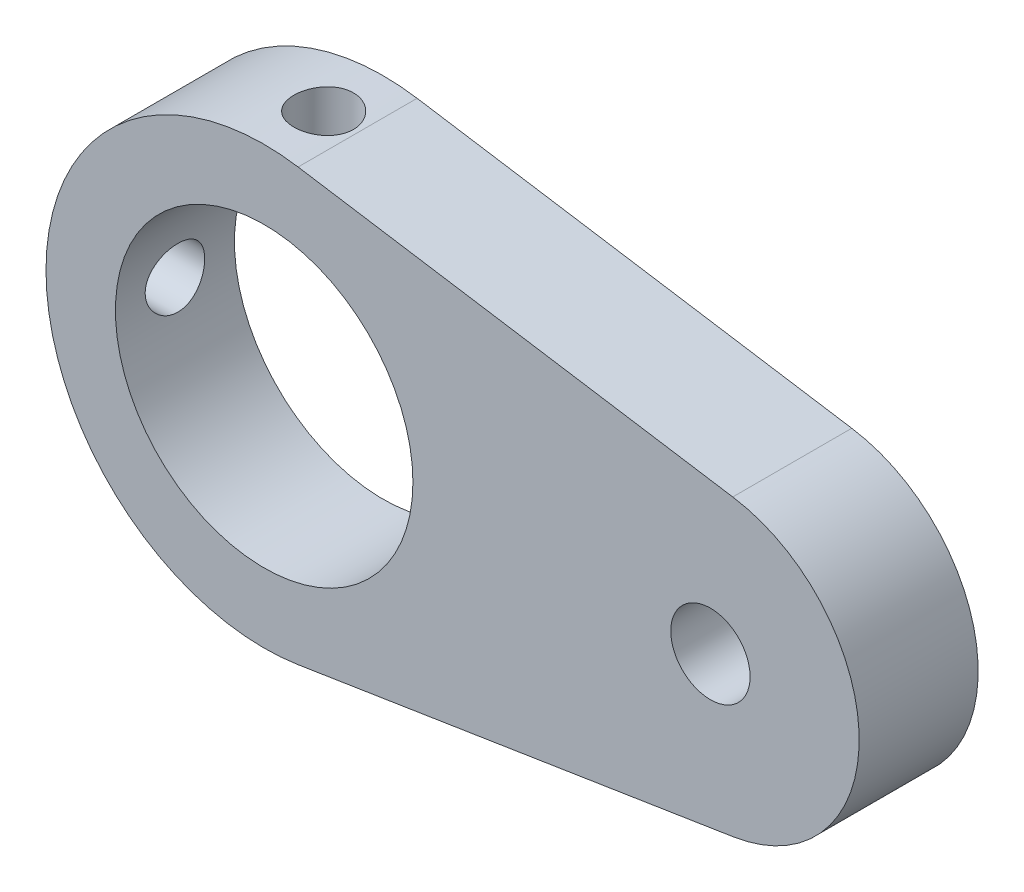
ISO-10303-21;
HEADER;
FILE_DESCRIPTION(('STEP AP214'),'2;1');
FILE_NAME('part.step','',(''),(''),'','','');
FILE_SCHEMA(('AUTOMOTIVE_DESIGN { 1 0 10303 214 1 1 1 1 }'));
ENDSEC;
DATA;
#1=APPLICATION_CONTEXT('core data for automotive mechanical design processes');
#2=APPLICATION_PROTOCOL_DEFINITION('international standard','automotive_design',2000,#1);
#3=PRODUCT_CONTEXT('',#1,'mechanical');
#4=PRODUCT('Part','Part','',(#3));
#5=PRODUCT_RELATED_PRODUCT_CATEGORY('part','',(#4));
#6=PRODUCT_DEFINITION_FORMATION('','',#4);
#7=PRODUCT_DEFINITION_CONTEXT('part definition',#1,'design');
#8=PRODUCT_DEFINITION('design','',#6,#7);
#9=PRODUCT_DEFINITION_SHAPE('','',#8);
#10=(LENGTH_UNIT() NAMED_UNIT(*) SI_UNIT(.MILLI.,.METRE.));
#11=(NAMED_UNIT(*) PLANE_ANGLE_UNIT() SI_UNIT($,.RADIAN.));
#12=(NAMED_UNIT(*) SI_UNIT($,.STERADIAN.) SOLID_ANGLE_UNIT());
#13=UNCERTAINTY_MEASURE_WITH_UNIT(LENGTH_MEASURE(1.E-05),#10,'distance_accuracy_value','');
#14=(GEOMETRIC_REPRESENTATION_CONTEXT(3) GLOBAL_UNCERTAINTY_ASSIGNED_CONTEXT((#13)) GLOBAL_UNIT_ASSIGNED_CONTEXT((#10,
#11,#12)) REPRESENTATION_CONTEXT('',''));
#15=CARTESIAN_POINT('',(0.,0.,0.));
#16=DIRECTION('',(0.,0.,1.));
#17=DIRECTION('',(1.,0.,0.));
#18=AXIS2_PLACEMENT_3D('',#15,#16,#17);
#19=CARTESIAN_POINT('',(0.,0.,12.));
#20=DIRECTION('',(0.,0.,-1.));
#21=DIRECTION('',(-1.,0.,0.));
#22=AXIS2_PLACEMENT_3D('',#19,#20,#21);
#23=CYLINDRICAL_SURFACE('',#22,22.);
#24=CARTESIAN_POINT('',(0.,22.,9.));
#25=CARTESIAN_POINT('',(-0.167676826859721,21.9999974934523,8.99999296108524));
#26=CARTESIAN_POINT('',(-0.335455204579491,21.9980628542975,8.98589481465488));
#27=CARTESIAN_POINT('',(-0.666334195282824,21.990531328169,8.92988223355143));
#28=CARTESIAN_POINT('',(-0.829429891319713,21.984930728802,8.88793960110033));
#29=CARTESIAN_POINT('',(-1.14610618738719,21.9706975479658,8.77750453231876));
#30=CARTESIAN_POINT('',(-1.29969344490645,21.9620671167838,8.70903092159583));
#31=CARTESIAN_POINT('',(-1.59317060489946,21.9427314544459,8.54752095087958));
#32=CARTESIAN_POINT('',(-1.73306265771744,21.9320265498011,8.45448845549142));
#33=CARTESIAN_POINT('',(-1.99611512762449,21.9096571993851,8.24585557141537));
#34=CARTESIAN_POINT('',(-2.11917356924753,21.8979875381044,8.13012715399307));
#35=CARTESIAN_POINT('',(-2.34418667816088,21.8750454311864,7.87966277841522));
#36=CARTESIAN_POINT('',(-2.44614021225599,21.863773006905,7.74492580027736));
#37=CARTESIAN_POINT('',(-2.62643701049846,21.8428507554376,7.45959612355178));
#38=CARTESIAN_POINT('',(-2.70468332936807,21.833207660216,7.30894162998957));
#39=CARTESIAN_POINT('',(-2.83472528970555,21.8167058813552,6.99647636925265));
#40=CARTESIAN_POINT('',(-2.8865221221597,21.8098470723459,6.83466610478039));
#41=CARTESIAN_POINT('',(-2.9618818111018,21.7997409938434,6.50554751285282));
#42=CARTESIAN_POINT('',(-2.98561797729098,21.7964715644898,6.33827956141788));
#43=CARTESIAN_POINT('',(-3.00471910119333,21.7938468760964,6.00210505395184));
#44=CARTESIAN_POINT('',(-3.00008540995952,21.7944914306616,5.83319857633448));
#45=CARTESIAN_POINT('',(-2.9627203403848,21.7996016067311,5.49975654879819));
#46=CARTESIAN_POINT('',(-2.9301807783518,21.8040411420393,5.33519904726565));
#47=CARTESIAN_POINT('',(-2.83822735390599,21.8162003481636,5.0139019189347));
#48=CARTESIAN_POINT('',(-2.77881285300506,21.8239200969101,4.85716247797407));
#49=CARTESIAN_POINT('',(-2.63459283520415,21.841799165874,4.55536014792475));
#50=CARTESIAN_POINT('',(-2.54970487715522,21.851966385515,4.41033714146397));
#51=CARTESIAN_POINT('',(-2.35700646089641,21.8735888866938,4.13652170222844));
#52=CARTESIAN_POINT('',(-2.24919475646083,21.8850442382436,4.00773015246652));
#53=CARTESIAN_POINT('',(-2.01265055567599,21.908067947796,3.76892089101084));
#54=CARTESIAN_POINT('',(-1.88375290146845,21.9196364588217,3.65906671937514));
#55=CARTESIAN_POINT('',(-1.60926188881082,21.9414949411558,3.46252701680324));
#56=CARTESIAN_POINT('',(-1.46366847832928,21.9517849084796,3.37584155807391));
#57=CARTESIAN_POINT('',(-1.1597859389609,21.9699350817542,3.22809627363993));
#58=CARTESIAN_POINT('',(-1.00149126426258,21.9777942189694,3.16704771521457));
#59=CARTESIAN_POINT('',(-0.676766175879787,21.9901879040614,3.07244432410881));
#60=CARTESIAN_POINT('',(-0.510336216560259,21.994722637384,3.03888795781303));
#61=CARTESIAN_POINT('',(-0.175477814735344,21.9999322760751,3.00043583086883));
#62=CARTESIAN_POINT('',(-0.0070756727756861,22.0006374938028,2.99531498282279));
#63=CARTESIAN_POINT('',(0.328184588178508,21.9981907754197,3.01328375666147));
#64=CARTESIAN_POINT('',(0.495042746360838,21.9950389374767,3.03637266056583));
#65=CARTESIAN_POINT('',(0.821806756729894,21.9852510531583,3.10991844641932));
#66=CARTESIAN_POINT('',(0.981737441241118,21.9786288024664,3.16026699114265));
#67=CARTESIAN_POINT('',(1.29088628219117,21.9626408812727,3.28678951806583));
#68=CARTESIAN_POINT('',(1.44010401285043,21.9532751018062,3.36296452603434));
#69=CARTESIAN_POINT('',(1.72458978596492,21.9327672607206,3.53951507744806));
#70=CARTESIAN_POINT('',(1.85976745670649,21.921614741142,3.64003500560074));
#71=CARTESIAN_POINT('',(2.11141402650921,21.8988110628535,3.86221915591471));
#72=CARTESIAN_POINT('',(2.22788203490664,21.8871598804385,3.98388438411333));
#73=CARTESIAN_POINT('',(2.43961065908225,21.8645773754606,4.24590166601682));
#74=CARTESIAN_POINT('',(2.53472132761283,21.8536515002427,4.38637542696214));
#75=CARTESIAN_POINT('',(2.69999679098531,21.8338493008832,4.68143661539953));
#76=CARTESIAN_POINT('',(2.77016216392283,21.8249729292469,4.83602371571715));
#77=CARTESIAN_POINT('',(2.88331699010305,21.8103129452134,5.15445551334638));
#78=CARTESIAN_POINT('',(2.92638854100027,21.8045199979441,5.31827058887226));
#79=CARTESIAN_POINT('',(2.98439621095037,21.7966568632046,5.65089304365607));
#80=CARTESIAN_POINT('',(2.99933390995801,21.7945864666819,5.8197001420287));
#81=CARTESIAN_POINT('',(3.00061713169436,21.7944097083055,6.15602195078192));
#82=CARTESIAN_POINT('',(2.98719829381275,21.796270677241,6.3235357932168));
#83=CARTESIAN_POINT('',(2.93265092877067,21.8036764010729,6.65390227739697));
#84=CARTESIAN_POINT('',(2.89152241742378,21.809221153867,6.81675492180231));
#85=CARTESIAN_POINT('',(2.7828011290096,21.8233590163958,7.13313027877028));
#86=CARTESIAN_POINT('',(2.71522193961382,21.8319505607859,7.28665773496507));
#87=CARTESIAN_POINT('',(2.5555407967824,21.85121622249,7.58023259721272));
#88=CARTESIAN_POINT('',(2.46343830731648,21.8618903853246,7.7202797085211));
#89=CARTESIAN_POINT('',(2.25645830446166,21.884224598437,7.98412007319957));
#90=CARTESIAN_POINT('',(2.14140556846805,21.8958918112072,8.10777527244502));
#91=CARTESIAN_POINT('',(1.89215973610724,21.9188357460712,8.33411069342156));
#92=CARTESIAN_POINT('',(1.7579621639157,21.9301123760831,8.43678599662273));
#93=CARTESIAN_POINT('',(1.473530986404,21.9510618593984,8.61865193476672));
#94=CARTESIAN_POINT('',(1.32322763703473,21.9607272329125,8.69773431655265));
#95=CARTESIAN_POINT('',(1.01141938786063,21.9772907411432,8.82941896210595));
#96=CARTESIAN_POINT('',(0.849926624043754,21.9841918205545,8.8820494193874));
#97=CARTESIAN_POINT('',(0.57303719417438,21.9928235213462,8.94702087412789));
#98=CARTESIAN_POINT('',(0.459371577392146,21.9955012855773,8.96685872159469));
#99=CARTESIAN_POINT('',(0.230486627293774,21.9990903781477,8.99335064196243));
#100=CARTESIAN_POINT('',(0.115267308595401,22.0000017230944,9.0000048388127));
#101=CARTESIAN_POINT('',(0.,22.,9.));
#102=B_SPLINE_CURVE_WITH_KNOTS('',3,(#24,#25,#26,#27,#28,#29,#30,#31,#32,#33,#34,#35,#36,#37,
#38,#39,#40,#41,#42,#43,#44,#45,#46,#47,#48,#49,#50,#51,#52,#53,#54,#55,#56,#57,#58,#59,#60,#61,
#62,#63,#64,#65,#66,#67,#68,#69,#70,#71,#72,#73,#74,#75,#76,#77,#78,#79,#80,#81,#82,#83,#84,#85,
#86,#87,#88,#89,#90,#91,#92,#93,#94,#95,#96,#97,#98,#99,#100,#101),.UNSPECIFIED.,.T.,.F.,(4,2,2,
2,2,2,2,2,2,2,2,2,2,2,2,2,2,2,2,2,2,2,2,2,2,2,2,2,2,2,2,2,2,2,2,2,2,2,4),(0.,0.5026093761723,
1.00572851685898,1.50849131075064,2.0111750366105,2.51678051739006,3.02241313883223,
3.53008635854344,4.03773671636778,4.54223504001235,5.04670933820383,5.54774357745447,
6.04878972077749,6.55147524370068,7.05418810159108,7.56104569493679,8.06790486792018,
8.57498657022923,9.08203998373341,9.58507392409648,10.0880950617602,10.5891315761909,
11.0901879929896,11.5942921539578,12.0984203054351,12.6059843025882,13.1135365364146,
13.619543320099,14.1255216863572,14.6273119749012,15.1291019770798,15.6306345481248,
16.1321780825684,16.6377084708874,17.1433572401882,17.6512916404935,18.1586835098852,
18.5041992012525,18.8497116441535),.UNSPECIFIED.);
#103=CARTESIAN_POINT('',(0.,22.,9.));
#104=VERTEX_POINT('',#103);
#105=EDGE_CURVE('E121',#104,#104,#102,.T.);
#106=ORIENTED_EDGE('',*,*,#105,.T.);
#107=EDGE_LOOP('',(#106));
#108=FACE_BOUND('',#107,.T.);
#109=CARTESIAN_POINT('',(0.,0.,0.));
#110=DIRECTION('',(0.,0.,1.));
#111=DIRECTION('',(1.,0.,0.));
#112=AXIS2_PLACEMENT_3D('',#109,#110,#111);
#113=CIRCLE('',#112,22.);
#114=CARTESIAN_POINT('',(3.42233737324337,21.7321790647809,0.));
#115=VERTEX_POINT('',#114);
#116=CARTESIAN_POINT('',(3.42233737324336,-21.7321790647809,0.));
#117=VERTEX_POINT('',#116);
#118=EDGE_CURVE('E76',#115,#117,#113,.T.);
#119=ORIENTED_EDGE('',*,*,#118,.T.);
#120=DIRECTION('',(0.,0.,-1.));
#121=VECTOR('',#120,1.);
#122=CARTESIAN_POINT('',(3.42233737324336,-21.7321790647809,12.));
#123=LINE('',#122,#121);
#124=CARTESIAN_POINT('',(3.42233737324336,-21.7321790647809,12.));
#125=VERTEX_POINT('',#124);
#126=EDGE_CURVE('E100',#125,#117,#123,.T.);
#127=ORIENTED_EDGE('',*,*,#126,.F.);
#128=CARTESIAN_POINT('',(0.,0.,12.));
#129=DIRECTION('',(0.,0.,1.));
#130=DIRECTION('',(1.,0.,0.));
#131=AXIS2_PLACEMENT_3D('',#128,#129,#130);
#132=CIRCLE('',#131,22.);
#133=CARTESIAN_POINT('',(3.42233737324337,21.7321790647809,12.));
#134=VERTEX_POINT('',#133);
#135=EDGE_CURVE('E93',#134,#125,#132,.T.);
#136=ORIENTED_EDGE('',*,*,#135,.F.);
#137=DIRECTION('',(0.,0.,-1.));
#138=VECTOR('',#137,1.);
#139=CARTESIAN_POINT('',(3.42233737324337,21.7321790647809,12.));
#140=LINE('',#139,#138);
#141=EDGE_CURVE('E50',#134,#115,#140,.T.);
#142=ORIENTED_EDGE('',*,*,#141,.T.);
#143=EDGE_LOOP('',(#119,#127,#136,#142));
#144=FACE_BOUND('',#143,.T.);
#145=CARTESIAN_POINT('',(-22.,0.,9.));
#146=CARTESIAN_POINT('',(-21.9999974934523,0.167676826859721,8.99999296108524));
#147=CARTESIAN_POINT('',(-21.9980628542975,0.335455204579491,8.98589481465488));
#148=CARTESIAN_POINT('',(-21.990531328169,0.666334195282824,8.92988223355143));
#149=CARTESIAN_POINT('',(-21.984930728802,0.829429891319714,8.88793960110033));
#150=CARTESIAN_POINT('',(-21.9706975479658,1.14610618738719,8.77750453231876));
#151=CARTESIAN_POINT('',(-21.9620671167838,1.29969344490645,8.70903092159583));
#152=CARTESIAN_POINT('',(-21.9427314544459,1.59317060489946,8.54752095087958));
#153=CARTESIAN_POINT('',(-21.9320265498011,1.73306265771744,8.45448845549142));
#154=CARTESIAN_POINT('',(-21.9096571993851,1.99611512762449,8.24585557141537));
#155=CARTESIAN_POINT('',(-21.8979875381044,2.11917356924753,8.13012715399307));
#156=CARTESIAN_POINT('',(-21.8750454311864,2.34418667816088,7.87966277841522));
#157=CARTESIAN_POINT('',(-21.863773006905,2.44614021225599,7.74492580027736));
#158=CARTESIAN_POINT('',(-21.8428507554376,2.62643701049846,7.45959612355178));
#159=CARTESIAN_POINT('',(-21.833207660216,2.70468332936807,7.30894162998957));
#160=CARTESIAN_POINT('',(-21.8167058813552,2.83472528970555,6.99647636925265));
#161=CARTESIAN_POINT('',(-21.8098470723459,2.8865221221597,6.83466610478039));
#162=CARTESIAN_POINT('',(-21.7997409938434,2.9618818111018,6.50554751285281));
#163=CARTESIAN_POINT('',(-21.7964715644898,2.98561797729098,6.33827956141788));
#164=CARTESIAN_POINT('',(-21.7938468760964,3.00471910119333,6.00210505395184));
#165=CARTESIAN_POINT('',(-21.7944914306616,3.00008540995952,5.83319857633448));
#166=CARTESIAN_POINT('',(-21.7996016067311,2.9627203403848,5.49975654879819));
#167=CARTESIAN_POINT('',(-21.8040411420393,2.9301807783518,5.33519904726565));
#168=CARTESIAN_POINT('',(-21.8162003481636,2.83822735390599,5.0139019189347));
#169=CARTESIAN_POINT('',(-21.8239200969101,2.77881285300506,4.85716247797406));
#170=CARTESIAN_POINT('',(-21.841799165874,2.63459283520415,4.55536014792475));
#171=CARTESIAN_POINT('',(-21.851966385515,2.54970487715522,4.41033714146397));
#172=CARTESIAN_POINT('',(-21.8735888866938,2.3570064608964,4.13652170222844));
#173=CARTESIAN_POINT('',(-21.8850442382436,2.24919475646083,4.00773015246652));
#174=CARTESIAN_POINT('',(-21.908067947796,2.01265055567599,3.76892089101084));
#175=CARTESIAN_POINT('',(-21.9196364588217,1.88375290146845,3.65906671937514));
#176=CARTESIAN_POINT('',(-21.9414949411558,1.60926188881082,3.46252701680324));
#177=CARTESIAN_POINT('',(-21.9517849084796,1.46366847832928,3.37584155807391));
#178=CARTESIAN_POINT('',(-21.9699350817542,1.15978593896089,3.22809627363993));
#179=CARTESIAN_POINT('',(-21.9777942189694,1.00149126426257,3.16704771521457));
#180=CARTESIAN_POINT('',(-21.9901879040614,0.676766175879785,3.07244432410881));
#181=CARTESIAN_POINT('',(-21.994722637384,0.510336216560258,3.03888795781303));
#182=CARTESIAN_POINT('',(-21.9999322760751,0.175477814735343,3.00043583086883));
#183=CARTESIAN_POINT('',(-22.0006374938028,0.00707567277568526,2.99531498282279));
#184=CARTESIAN_POINT('',(-21.9981907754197,-0.328184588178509,3.01328375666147));
#185=CARTESIAN_POINT('',(-21.9950389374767,-0.495042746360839,3.03637266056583));
#186=CARTESIAN_POINT('',(-21.9852510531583,-0.821806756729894,3.10991844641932));
#187=CARTESIAN_POINT('',(-21.9786288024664,-0.981737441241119,3.16026699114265));
#188=CARTESIAN_POINT('',(-21.9626408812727,-1.29088628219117,3.28678951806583));
#189=CARTESIAN_POINT('',(-21.9532751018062,-1.44010401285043,3.36296452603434));
#190=CARTESIAN_POINT('',(-21.9327672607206,-1.72458978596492,3.53951507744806));
#191=CARTESIAN_POINT('',(-21.921614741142,-1.85976745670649,3.64003500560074));
#192=CARTESIAN_POINT('',(-21.8988110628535,-2.11141402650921,3.86221915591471));
#193=CARTESIAN_POINT('',(-21.8871598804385,-2.22788203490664,3.98388438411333));
#194=CARTESIAN_POINT('',(-21.8645773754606,-2.43961065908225,4.24590166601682));
#195=CARTESIAN_POINT('',(-21.8536515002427,-2.53472132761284,4.38637542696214));
#196=CARTESIAN_POINT('',(-21.8338493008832,-2.69999679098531,4.68143661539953));
#197=CARTESIAN_POINT('',(-21.8249729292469,-2.77016216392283,4.83602371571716));
#198=CARTESIAN_POINT('',(-21.8103129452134,-2.88331699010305,5.15445551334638));
#199=CARTESIAN_POINT('',(-21.8045199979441,-2.92638854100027,5.31827058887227));
#200=CARTESIAN_POINT('',(-21.7966568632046,-2.98439621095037,5.65089304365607));
#201=CARTESIAN_POINT('',(-21.7945864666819,-2.99933390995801,5.8197001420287));
#202=CARTESIAN_POINT('',(-21.7944097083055,-3.00061713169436,6.15602195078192));
#203=CARTESIAN_POINT('',(-21.796270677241,-2.98719829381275,6.3235357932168));
#204=CARTESIAN_POINT('',(-21.8036764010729,-2.93265092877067,6.65390227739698));
#205=CARTESIAN_POINT('',(-21.809221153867,-2.89152241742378,6.81675492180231));
#206=CARTESIAN_POINT('',(-21.8233590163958,-2.7828011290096,7.13313027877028));
#207=CARTESIAN_POINT('',(-21.8319505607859,-2.71522193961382,7.28665773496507));
#208=CARTESIAN_POINT('',(-21.85121622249,-2.55554079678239,7.58023259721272));
#209=CARTESIAN_POINT('',(-21.8618903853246,-2.46343830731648,7.72027970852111));
#210=CARTESIAN_POINT('',(-21.884224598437,-2.25645830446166,7.98412007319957));
#211=CARTESIAN_POINT('',(-21.8958918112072,-2.14140556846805,8.10777527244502));
#212=CARTESIAN_POINT('',(-21.9188357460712,-1.89215973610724,8.33411069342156));
#213=CARTESIAN_POINT('',(-21.9301123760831,-1.7579621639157,8.43678599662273));
#214=CARTESIAN_POINT('',(-21.9510618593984,-1.473530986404,8.61865193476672));
#215=CARTESIAN_POINT('',(-21.9607272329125,-1.32322763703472,8.69773431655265));
#216=CARTESIAN_POINT('',(-21.9772907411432,-1.01141938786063,8.82941896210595));
#217=CARTESIAN_POINT('',(-21.9841918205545,-0.849926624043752,8.88204941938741));
#218=CARTESIAN_POINT('',(-21.9928235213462,-0.573037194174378,8.94702087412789));
#219=CARTESIAN_POINT('',(-21.9955012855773,-0.459371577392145,8.96685872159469));
#220=CARTESIAN_POINT('',(-21.9990903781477,-0.230486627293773,8.99335064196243));
#221=CARTESIAN_POINT('',(-22.0000017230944,-0.1152673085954,9.0000048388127));
#222=CARTESIAN_POINT('',(-22.,0.,9.));
#223=B_SPLINE_CURVE_WITH_KNOTS('',3,(#145,#146,#147,#148,#149,#150,#151,#152,#153,#154,#155,
#156,#157,#158,#159,#160,#161,#162,#163,#164,#165,#166,#167,#168,#169,#170,#171,#172,#173,#174,
#175,#176,#177,#178,#179,#180,#181,#182,#183,#184,#185,#186,#187,#188,#189,#190,#191,#192,#193,
#194,#195,#196,#197,#198,#199,#200,#201,#202,#203,#204,#205,#206,#207,#208,#209,#210,#211,#212,
#213,#214,#215,#216,#217,#218,#219,#220,#221,#222),.UNSPECIFIED.,.T.,.F.,(4,2,2,2,2,2,2,2,2,2,2,
2,2,2,2,2,2,2,2,2,2,2,2,2,2,2,2,2,2,2,2,2,2,2,2,2,2,2,4),(0.,0.5026093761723,1.00572851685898,
1.50849131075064,2.0111750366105,2.51678051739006,3.02241313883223,3.53008635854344,
4.03773671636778,4.54223504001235,5.04670933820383,5.54774357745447,6.04878972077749,
6.55147524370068,7.05418810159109,7.56104569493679,8.06790486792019,8.57498657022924,
9.08203998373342,9.58507392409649,10.0880950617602,10.5891315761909,11.0901879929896,
11.5942921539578,12.0984203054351,12.6059843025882,13.1135365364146,13.619543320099,
14.1255216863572,14.6273119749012,15.1291019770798,15.6306345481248,16.1321780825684,
16.6377084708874,17.1433572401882,17.6512916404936,18.1586835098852,18.5041992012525,
18.8497116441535),.UNSPECIFIED.);
#224=CARTESIAN_POINT('',(-22.,0.,9.));
#225=VERTEX_POINT('',#224);
#226=EDGE_CURVE('E122',#225,#225,#223,.T.);
#227=ORIENTED_EDGE('',*,*,#226,.F.);
#228=EDGE_LOOP('',(#227));
#229=FACE_BOUND('',#228,.T.);
#230=ADVANCED_FACE('F36',(#108,#144,#229),#23,.T.);
#231=CARTESIAN_POINT('',(0.,0.,12.));
#232=DIRECTION('',(0.,0.,-1.));
#233=DIRECTION('',(-1.,0.,0.));
#234=AXIS2_PLACEMENT_3D('',#231,#232,#233);
#235=CYLINDRICAL_SURFACE('',#234,15.);
#236=CARTESIAN_POINT('',(0.,0.,0.));
#237=DIRECTION('',(0.,0.,1.));
#238=DIRECTION('',(1.,0.,0.));
#239=AXIS2_PLACEMENT_3D('',#236,#237,#238);
#240=CIRCLE('',#239,15.);
#241=CARTESIAN_POINT('',(15.,0.,0.));
#242=VERTEX_POINT('',#241);
#243=EDGE_CURVE('E170',#242,#242,#240,.T.);
#244=ORIENTED_EDGE('',*,*,#243,.F.);
#245=EDGE_LOOP('',(#244));
#246=FACE_BOUND('',#245,.T.);
#247=CARTESIAN_POINT('',(0.,0.,12.));
#248=DIRECTION('',(0.,0.,1.));
#249=DIRECTION('',(1.,0.,0.));
#250=AXIS2_PLACEMENT_3D('',#247,#248,#249);
#251=CIRCLE('',#250,15.);
#252=CARTESIAN_POINT('',(15.,0.,12.));
#253=VERTEX_POINT('',#252);
#254=EDGE_CURVE('E111',#253,#253,#251,.T.);
#255=ORIENTED_EDGE('',*,*,#254,.T.);
#256=EDGE_LOOP('',(#255));
#257=FACE_BOUND('',#256,.T.);
#258=CARTESIAN_POINT('',(0.,15.,9.));
#259=CARTESIAN_POINT('',(-0.166730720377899,14.9999969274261,8.99999386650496));
#260=CARTESIAN_POINT('',(-0.333538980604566,14.9971915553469,8.98605347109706));
#261=CARTESIAN_POINT('',(-0.662440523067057,14.9862709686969,8.93070449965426));
#262=CARTESIAN_POINT('',(-0.824529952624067,14.9781515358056,8.88927410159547));
#263=CARTESIAN_POINT('',(-1.13919091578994,14.9575094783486,8.78027617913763));
#264=CARTESIAN_POINT('',(-1.2917714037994,14.9449910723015,8.71273368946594));
#265=CARTESIAN_POINT('',(-1.58342396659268,14.9169119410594,8.55350325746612));
#266=CARTESIAN_POINT('',(-1.72249684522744,14.9013513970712,8.46181675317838));
#267=CARTESIAN_POINT('',(-1.98508043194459,14.8686649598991,8.2555845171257));
#268=CARTESIAN_POINT('',(-2.10838185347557,14.8515223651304,8.14077493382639));
#269=CARTESIAN_POINT('',(-2.33411026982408,14.8177254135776,7.89212275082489));
#270=CARTESIAN_POINT('',(-2.43653563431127,14.8010710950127,7.75827866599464));
#271=CARTESIAN_POINT('',(-2.61849526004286,14.7699732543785,7.47385142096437));
#272=CARTESIAN_POINT('',(-2.6978128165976,14.7555512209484,7.32312706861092));
#273=CARTESIAN_POINT('',(-2.82991699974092,14.7307880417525,7.01015454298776));
#274=CARTESIAN_POINT('',(-2.88270624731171,14.7204464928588,6.84790750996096));
#275=CARTESIAN_POINT('',(-2.95957589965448,14.7051841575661,6.51874690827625));
#276=CARTESIAN_POINT('',(-2.98402349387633,14.7001941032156,6.35192236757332));
#277=CARTESIAN_POINT('',(-3.00465638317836,14.6959912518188,6.01647053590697));
#278=CARTESIAN_POINT('',(-3.0008445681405,14.6967778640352,5.84784343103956));
#279=CARTESIAN_POINT('',(-2.96536371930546,14.7039765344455,5.51625963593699));
#280=CARTESIAN_POINT('',(-2.93411562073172,14.7103035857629,5.35325578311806));
#281=CARTESIAN_POINT('',(-2.84531365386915,14.7277363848,5.03485177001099));
#282=CARTESIAN_POINT('',(-2.78775852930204,14.7388423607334,4.87945197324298));
#283=CARTESIAN_POINT('',(-2.64757435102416,14.7646685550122,4.5794542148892));
#284=CARTESIAN_POINT('',(-2.56477845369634,14.7794126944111,4.43493636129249));
#285=CARTESIAN_POINT('',(-2.37658072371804,14.8108385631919,4.16168745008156));
#286=CARTESIAN_POINT('',(-2.27117629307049,14.827520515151,4.03295820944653));
#287=CARTESIAN_POINT('',(-2.03849980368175,14.8613106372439,3.79251179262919));
#288=CARTESIAN_POINT('',(-1.91086848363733,14.8784210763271,3.68114229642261));
#289=CARTESIAN_POINT('',(-1.63855507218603,14.9108654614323,3.48133846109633));
#290=CARTESIAN_POINT('',(-1.49387276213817,14.9261993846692,3.39290441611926));
#291=CARTESIAN_POINT('',(-1.19117816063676,14.9534007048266,3.24141747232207));
#292=CARTESIAN_POINT('',(-1.0331454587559,14.9652626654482,3.17840431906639));
#293=CARTESIAN_POINT('',(-0.708446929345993,14.9841422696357,3.0799185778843));
#294=CARTESIAN_POINT('',(-0.541782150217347,14.9911605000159,3.04444265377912));
#295=CARTESIAN_POINT('',(-0.20753821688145,14.999480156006,3.00253063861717));
#296=CARTESIAN_POINT('',(-0.0400209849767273,15.0008752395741,2.99561874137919));
#297=CARTESIAN_POINT('',(0.293774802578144,14.9980515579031,3.00974957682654));
#298=CARTESIAN_POINT('',(0.460053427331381,14.9938331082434,3.03079073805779));
#299=CARTESIAN_POINT('',(0.785116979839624,14.9803149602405,3.09983512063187));
#300=CARTESIAN_POINT('',(0.94395584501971,14.9710612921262,3.14759420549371));
#301=CARTESIAN_POINT('',(1.251370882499,14.948506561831,3.26845194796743));
#302=CARTESIAN_POINT('',(1.39994628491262,14.9352051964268,3.34155250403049));
#303=CARTESIAN_POINT('',(1.68462352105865,14.9057973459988,3.51204747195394));
#304=CARTESIAN_POINT('',(1.82055038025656,14.8896585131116,3.60972834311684));
#305=CARTESIAN_POINT('',(2.07425405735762,14.8564420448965,3.82622757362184));
#306=CARTESIAN_POINT('',(2.19202892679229,14.8393643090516,3.9450481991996));
#307=CARTESIAN_POINT('',(2.40792177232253,14.8058791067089,4.20262005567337));
#308=CARTESIAN_POINT('',(2.50571310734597,14.7894858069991,4.34164723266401));
#309=CARTESIAN_POINT('',(2.67655626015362,14.7595257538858,4.63443408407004));
#310=CARTESIAN_POINT('',(2.74960906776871,14.7459588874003,4.78819316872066));
#311=CARTESIAN_POINT('',(2.86845552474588,14.7233022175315,5.10530473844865));
#312=CARTESIAN_POINT('',(2.91439049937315,14.7141892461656,5.26860252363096));
#313=CARTESIAN_POINT('',(2.97812595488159,14.7014231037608,5.60080036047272));
#314=CARTESIAN_POINT('',(2.99593010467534,14.6977692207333,5.76969967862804));
#315=CARTESIAN_POINT('',(3.00276273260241,14.6963744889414,6.10502659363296));
#316=CARTESIAN_POINT('',(2.99230736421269,14.698527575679,6.27144344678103));
#317=CARTESIAN_POINT('',(2.94405691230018,14.7082672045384,6.60009494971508));
#318=CARTESIAN_POINT('',(2.90626204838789,14.7158537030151,6.76232963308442));
#319=CARTESIAN_POINT('',(2.80463570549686,14.7355579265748,7.07768313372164));
#320=CARTESIAN_POINT('',(2.74086752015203,14.7476646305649,7.23082308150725));
#321=CARTESIAN_POINT('',(2.58916393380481,14.7750514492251,7.52431116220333));
#322=CARTESIAN_POINT('',(2.50122650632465,14.7903318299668,7.66465822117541));
#323=CARTESIAN_POINT('',(2.30191774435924,14.8226688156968,7.93114671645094));
#324=CARTESIAN_POINT('',(2.19017366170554,14.839751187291,8.05700629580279));
#325=CARTESIAN_POINT('',(1.94719310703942,14.8735824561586,8.28835861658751));
#326=CARTESIAN_POINT('',(1.81595216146,14.8903312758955,8.39384667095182));
#327=CARTESIAN_POINT('',(1.53605288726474,14.9218149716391,8.58250393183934));
#328=CARTESIAN_POINT('',(1.3872266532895,14.9365269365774,8.66542800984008));
#329=CARTESIAN_POINT('',(1.0774990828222,14.96205375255,8.80495836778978));
#330=CARTESIAN_POINT('',(0.916608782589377,14.9728721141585,8.86158836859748));
#331=CARTESIAN_POINT('',(0.629464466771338,14.9872911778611,8.93595584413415));
#332=CARTESIAN_POINT('',(0.504844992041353,14.9920290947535,8.95992958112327));
#333=CARTESIAN_POINT('',(0.253498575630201,14.9983846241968,8.99195373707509));
#334=CARTESIAN_POINT('',(0.126771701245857,15.0000023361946,9.0000046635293));
#335=CARTESIAN_POINT('',(0.,15.,9.));
#336=B_SPLINE_CURVE_WITH_KNOTS('',3,(#258,#259,#260,#261,#262,#263,#264,#265,#266,#267,#268,
#269,#270,#271,#272,#273,#274,#275,#276,#277,#278,#279,#280,#281,#282,#283,#284,#285,#286,#287,
#288,#289,#290,#291,#292,#293,#294,#295,#296,#297,#298,#299,#300,#301,#302,#303,#304,#305,#306,
#307,#308,#309,#310,#311,#312,#313,#314,#315,#316,#317,#318,#319,#320,#321,#322,#323,#324,#325,
#326,#327,#328,#329,#330,#331,#332,#333,#334,#335),.UNSPECIFIED.,.T.,.F.,(4,2,2,2,2,2,2,2,2,2,2,
2,2,2,2,2,2,2,2,2,2,2,2,2,2,2,2,2,2,2,2,2,2,2,2,2,2,2,4),(0.,0.499728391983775,
0.999853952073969,1.49950120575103,1.99911870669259,2.50479801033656,3.0105167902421,
3.52083585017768,4.03110448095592,4.53468555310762,5.03821512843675,5.53415181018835,
6.03011217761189,6.52942470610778,7.02879464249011,7.53714757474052,8.04550702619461,
8.55465824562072,9.06374777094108,9.56432207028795,10.064868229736,10.5609136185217,
11.0569961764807,11.5591519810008,12.0613616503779,12.5712188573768,13.081055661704,
13.5882114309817,14.0953010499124,14.593191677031,15.0910783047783,15.5877588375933,
16.084481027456,16.5896422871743,17.0949196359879,17.6054849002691,18.1155886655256,
18.4955632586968,18.8755257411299),.UNSPECIFIED.);
#337=CARTESIAN_POINT('',(0.,15.,9.));
#338=VERTEX_POINT('',#337);
#339=EDGE_CURVE('E116',#338,#338,#336,.T.);
#340=ORIENTED_EDGE('',*,*,#339,.F.);
#341=EDGE_LOOP('',(#340));
#342=FACE_BOUND('',#341,.T.);
#343=CARTESIAN_POINT('',(-15.,0.,9.));
#344=CARTESIAN_POINT('',(-14.9999969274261,0.1667307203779,8.99999386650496));
#345=CARTESIAN_POINT('',(-14.9971915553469,0.333538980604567,8.98605347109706));
#346=CARTESIAN_POINT('',(-14.9862709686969,0.662440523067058,8.93070449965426));
#347=CARTESIAN_POINT('',(-14.9781515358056,0.824529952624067,8.88927410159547));
#348=CARTESIAN_POINT('',(-14.9575094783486,1.13919091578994,8.78027617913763));
#349=CARTESIAN_POINT('',(-14.9449910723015,1.2917714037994,8.71273368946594));
#350=CARTESIAN_POINT('',(-14.9169119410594,1.58342396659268,8.55350325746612));
#351=CARTESIAN_POINT('',(-14.9013513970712,1.72249684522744,8.46181675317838));
#352=CARTESIAN_POINT('',(-14.8686649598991,1.9850804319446,8.2555845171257));
#353=CARTESIAN_POINT('',(-14.8515223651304,2.10838185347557,8.14077493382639));
#354=CARTESIAN_POINT('',(-14.8177254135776,2.33411026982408,7.89212275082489));
#355=CARTESIAN_POINT('',(-14.8010710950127,2.43653563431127,7.75827866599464));
#356=CARTESIAN_POINT('',(-14.7699732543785,2.61849526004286,7.47385142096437));
#357=CARTESIAN_POINT('',(-14.7555512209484,2.6978128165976,7.32312706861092));
#358=CARTESIAN_POINT('',(-14.7307880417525,2.82991699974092,7.01015454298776));
#359=CARTESIAN_POINT('',(-14.7204464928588,2.88270624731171,6.84790750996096));
#360=CARTESIAN_POINT('',(-14.7051841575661,2.95957589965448,6.51874690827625));
#361=CARTESIAN_POINT('',(-14.7001941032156,2.98402349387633,6.35192236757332));
#362=CARTESIAN_POINT('',(-14.6959912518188,3.00465638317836,6.01647053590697));
#363=CARTESIAN_POINT('',(-14.6967778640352,3.0008445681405,5.84784343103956));
#364=CARTESIAN_POINT('',(-14.7039765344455,2.96536371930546,5.51625963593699));
#365=CARTESIAN_POINT('',(-14.7103035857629,2.93411562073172,5.35325578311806));
#366=CARTESIAN_POINT('',(-14.7277363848,2.84531365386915,5.03485177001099));
#367=CARTESIAN_POINT('',(-14.7388423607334,2.78775852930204,4.87945197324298));
#368=CARTESIAN_POINT('',(-14.7646685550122,2.64757435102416,4.5794542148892));
#369=CARTESIAN_POINT('',(-14.7794126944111,2.56477845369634,4.43493636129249));
#370=CARTESIAN_POINT('',(-14.8108385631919,2.37658072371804,4.16168745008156));
#371=CARTESIAN_POINT('',(-14.827520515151,2.27117629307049,4.03295820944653));
#372=CARTESIAN_POINT('',(-14.8613106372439,2.03849980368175,3.79251179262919));
#373=CARTESIAN_POINT('',(-14.8784210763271,1.91086848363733,3.68114229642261));
#374=CARTESIAN_POINT('',(-14.9108654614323,1.63855507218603,3.48133846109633));
#375=CARTESIAN_POINT('',(-14.9261993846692,1.49387276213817,3.39290441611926));
#376=CARTESIAN_POINT('',(-14.9534007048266,1.19117816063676,3.24141747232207));
#377=CARTESIAN_POINT('',(-14.9652626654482,1.0331454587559,3.17840431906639));
#378=CARTESIAN_POINT('',(-14.9841422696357,0.708446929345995,3.0799185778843));
#379=CARTESIAN_POINT('',(-14.9911605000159,0.541782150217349,3.04444265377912));
#380=CARTESIAN_POINT('',(-14.999480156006,0.207538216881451,3.00253063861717));
#381=CARTESIAN_POINT('',(-15.0008752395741,0.0400209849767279,2.99561874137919));
#382=CARTESIAN_POINT('',(-14.9980515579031,-0.293774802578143,3.00974957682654));
#383=CARTESIAN_POINT('',(-14.9938331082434,-0.460053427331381,3.03079073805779));
#384=CARTESIAN_POINT('',(-14.9803149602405,-0.785116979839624,3.09983512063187));
#385=CARTESIAN_POINT('',(-14.9710612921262,-0.94395584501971,3.14759420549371));
#386=CARTESIAN_POINT('',(-14.948506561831,-1.251370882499,3.26845194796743));
#387=CARTESIAN_POINT('',(-14.9352051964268,-1.39994628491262,3.34155250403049));
#388=CARTESIAN_POINT('',(-14.9057973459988,-1.68462352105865,3.51204747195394));
#389=CARTESIAN_POINT('',(-14.8896585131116,-1.82055038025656,3.60972834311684));
#390=CARTESIAN_POINT('',(-14.8564420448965,-2.07425405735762,3.82622757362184));
#391=CARTESIAN_POINT('',(-14.8393643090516,-2.19202892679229,3.9450481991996));
#392=CARTESIAN_POINT('',(-14.8058791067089,-2.40792177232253,4.20262005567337));
#393=CARTESIAN_POINT('',(-14.7894858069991,-2.50571310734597,4.34164723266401));
#394=CARTESIAN_POINT('',(-14.7595257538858,-2.67655626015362,4.63443408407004));
#395=CARTESIAN_POINT('',(-14.7459588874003,-2.74960906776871,4.78819316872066));
#396=CARTESIAN_POINT('',(-14.7233022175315,-2.86845552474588,5.10530473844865));
#397=CARTESIAN_POINT('',(-14.7141892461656,-2.91439049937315,5.26860252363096));
#398=CARTESIAN_POINT('',(-14.7014231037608,-2.97812595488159,5.60080036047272));
#399=CARTESIAN_POINT('',(-14.6977692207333,-2.99593010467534,5.76969967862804));
#400=CARTESIAN_POINT('',(-14.6963744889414,-3.00276273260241,6.10502659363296));
#401=CARTESIAN_POINT('',(-14.698527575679,-2.99230736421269,6.27144344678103));
#402=CARTESIAN_POINT('',(-14.7082672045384,-2.94405691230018,6.60009494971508));
#403=CARTESIAN_POINT('',(-14.7158537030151,-2.9062620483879,6.76232963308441));
#404=CARTESIAN_POINT('',(-14.7355579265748,-2.80463570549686,7.07768313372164));
#405=CARTESIAN_POINT('',(-14.7476646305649,-2.74086752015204,7.23082308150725));
#406=CARTESIAN_POINT('',(-14.7750514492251,-2.58916393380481,7.52431116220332));
#407=CARTESIAN_POINT('',(-14.7903318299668,-2.50122650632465,7.66465822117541));
#408=CARTESIAN_POINT('',(-14.8226688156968,-2.30191774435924,7.93114671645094));
#409=CARTESIAN_POINT('',(-14.839751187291,-2.19017366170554,8.05700629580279));
#410=CARTESIAN_POINT('',(-14.8735824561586,-1.94719310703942,8.28835861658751));
#411=CARTESIAN_POINT('',(-14.8903312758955,-1.81595216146,8.39384667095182));
#412=CARTESIAN_POINT('',(-14.9218149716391,-1.53605288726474,8.58250393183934));
#413=CARTESIAN_POINT('',(-14.9365269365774,-1.3872266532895,8.66542800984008));
#414=CARTESIAN_POINT('',(-14.96205375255,-1.0774990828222,8.80495836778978));
#415=CARTESIAN_POINT('',(-14.9728721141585,-0.916608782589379,8.86158836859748));
#416=CARTESIAN_POINT('',(-14.9872911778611,-0.629464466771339,8.93595584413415));
#417=CARTESIAN_POINT('',(-14.9920290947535,-0.504844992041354,8.95992958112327));
#418=CARTESIAN_POINT('',(-14.9983846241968,-0.2534985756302,8.99195373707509));
#419=CARTESIAN_POINT('',(-15.0000023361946,-0.126771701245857,9.0000046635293));
#420=CARTESIAN_POINT('',(-15.,0.,9.));
#421=B_SPLINE_CURVE_WITH_KNOTS('',3,(#343,#344,#345,#346,#347,#348,#349,#350,#351,#352,#353,
#354,#355,#356,#357,#358,#359,#360,#361,#362,#363,#364,#365,#366,#367,#368,#369,#370,#371,#372,
#373,#374,#375,#376,#377,#378,#379,#380,#381,#382,#383,#384,#385,#386,#387,#388,#389,#390,#391,
#392,#393,#394,#395,#396,#397,#398,#399,#400,#401,#402,#403,#404,#405,#406,#407,#408,#409,#410,
#411,#412,#413,#414,#415,#416,#417,#418,#419,#420),.UNSPECIFIED.,.T.,.F.,(4,2,2,2,2,2,2,2,2,2,2,
2,2,2,2,2,2,2,2,2,2,2,2,2,2,2,2,2,2,2,2,2,2,2,2,2,2,2,4),(0.,0.499728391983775,0.99985395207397,
1.49950120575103,1.99911870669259,2.50479801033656,3.0105167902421,3.52083585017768,
4.03110448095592,4.53468555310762,5.03821512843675,5.53415181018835,6.03011217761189,
6.52942470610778,7.02879464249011,7.53714757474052,8.04550702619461,8.55465824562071,
9.06374777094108,9.56432207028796,10.064868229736,10.5609136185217,11.0569961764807,
11.5591519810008,12.0613616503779,12.5712188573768,13.081055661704,13.5882114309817,
14.0953010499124,14.593191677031,15.0910783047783,15.5877588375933,16.084481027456,
16.5896422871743,17.0949196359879,17.6054849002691,18.1155886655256,18.4955632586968,
18.8755257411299),.UNSPECIFIED.);
#422=CARTESIAN_POINT('',(-15.,0.,9.));
#423=VERTEX_POINT('',#422);
#424=EDGE_CURVE('E40',#423,#423,#421,.T.);
#425=ORIENTED_EDGE('',*,*,#424,.T.);
#426=EDGE_LOOP('',(#425));
#427=FACE_BOUND('',#426,.T.);
#428=ADVANCED_FACE('F123',(#246,#257,#342,#427),#235,.F.);
#429=CARTESIAN_POINT('',(45.,0.,12.));
#430=DIRECTION('',(0.,0.,1.));
#431=DIRECTION('',(1.,0.,0.));
#432=AXIS2_PLACEMENT_3D('',#429,#430,#431);
#433=PLANE('',#432);
#434=ORIENTED_EDGE('',*,*,#254,.F.);
#435=EDGE_LOOP('',(#434));
#436=FACE_BOUND('',#435,.T.);
#437=CARTESIAN_POINT('',(45.,0.,12.));
#438=DIRECTION('',(0.,0.,1.));
#439=DIRECTION('',(1.,0.,0.));
#440=AXIS2_PLACEMENT_3D('',#437,#438,#439);
#441=CIRCLE('',#440,14.9999999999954);
#442=CARTESIAN_POINT('',(47.2503388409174,-14.830238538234,12.));
#443=VERTEX_POINT('',#442);
#444=CARTESIAN_POINT('',(47.2503388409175,14.830238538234,12.));
#445=VERTEX_POINT('',#444);
#446=EDGE_CURVE('E95',#443,#445,#441,.T.);
#447=ORIENTED_EDGE('',*,*,#446,.T.);
#448=DIRECTION('',(-0.987826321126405,0.15556078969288,0.));
#449=VECTOR('',#448,1.);
#450=CARTESIAN_POINT('',(47.2503388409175,14.830238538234,12.));
#451=LINE('',#450,#449);
#452=EDGE_CURVE('E89',#445,#134,#451,.T.);
#453=ORIENTED_EDGE('',*,*,#452,.T.);
#454=ORIENTED_EDGE('',*,*,#135,.T.);
#455=DIRECTION('',(0.987826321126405,0.15556078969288,0.));
#456=VECTOR('',#455,1.);
#457=CARTESIAN_POINT('',(47.2503388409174,-14.830238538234,12.));
#458=LINE('',#457,#456);
#459=EDGE_CURVE('E59',#125,#443,#458,.T.);
#460=ORIENTED_EDGE('',*,*,#459,.T.);
#461=EDGE_LOOP('',(#447,#453,#454,#460));
#462=FACE_BOUND('',#461,.T.);
#463=CARTESIAN_POINT('',(45.,0.,12.));
#464=DIRECTION('',(0.,0.,1.));
#465=DIRECTION('',(1.,0.,0.));
#466=AXIS2_PLACEMENT_3D('',#463,#464,#465);
#467=CIRCLE('',#466,4.00000000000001);
#468=CARTESIAN_POINT('',(49.,0.,12.));
#469=VERTEX_POINT('',#468);
#470=EDGE_CURVE('E145',#469,#469,#467,.T.);
#471=ORIENTED_EDGE('',*,*,#470,.F.);
#472=EDGE_LOOP('',(#471));
#473=FACE_BOUND('',#472,.T.);
#474=ADVANCED_FACE('F90',(#436,#462,#473),#433,.T.);
#475=CARTESIAN_POINT('',(45.,0.,0.));
#476=DIRECTION('',(0.,0.,1.));
#477=DIRECTION('',(1.,0.,0.));
#478=AXIS2_PLACEMENT_3D('',#475,#476,#477);
#479=PLANE('',#478);
#480=CARTESIAN_POINT('',(45.,0.,0.));
#481=DIRECTION('',(0.,0.,1.));
#482=DIRECTION('',(1.,0.,0.));
#483=AXIS2_PLACEMENT_3D('',#480,#481,#482);
#484=CIRCLE('',#483,14.9999999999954);
#485=CARTESIAN_POINT('',(47.2503388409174,-14.830238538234,0.));
#486=VERTEX_POINT('',#485);
#487=CARTESIAN_POINT('',(47.2503388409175,14.830238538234,0.));
#488=VERTEX_POINT('',#487);
#489=EDGE_CURVE('E108',#486,#488,#484,.T.);
#490=ORIENTED_EDGE('',*,*,#489,.F.);
#491=DIRECTION('',(0.987826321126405,0.15556078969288,0.));
#492=VECTOR('',#491,1.);
#493=CARTESIAN_POINT('',(47.2503388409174,-14.830238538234,0.));
#494=LINE('',#493,#492);
#495=EDGE_CURVE('E82',#117,#486,#494,.T.);
#496=ORIENTED_EDGE('',*,*,#495,.F.);
#497=ORIENTED_EDGE('',*,*,#118,.F.);
#498=DIRECTION('',(-0.987826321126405,0.15556078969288,0.));
#499=VECTOR('',#498,1.);
#500=CARTESIAN_POINT('',(47.2503388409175,14.830238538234,0.));
#501=LINE('',#500,#499);
#502=EDGE_CURVE('E99',#488,#115,#501,.T.);
#503=ORIENTED_EDGE('',*,*,#502,.F.);
#504=EDGE_LOOP('',(#490,#496,#497,#503));
#505=FACE_BOUND('',#504,.T.);
#506=ORIENTED_EDGE('',*,*,#243,.T.);
#507=EDGE_LOOP('',(#506));
#508=FACE_BOUND('',#507,.T.);
#509=CARTESIAN_POINT('',(45.,0.,0.));
#510=DIRECTION('',(0.,0.,1.));
#511=DIRECTION('',(1.,0.,0.));
#512=AXIS2_PLACEMENT_3D('',#509,#510,#511);
#513=CIRCLE('',#512,4.00000000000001);
#514=CARTESIAN_POINT('',(49.,0.,0.));
#515=VERTEX_POINT('',#514);
#516=EDGE_CURVE('E142',#515,#515,#513,.T.);
#517=ORIENTED_EDGE('',*,*,#516,.T.);
#518=EDGE_LOOP('',(#517));
#519=FACE_BOUND('',#518,.T.);
#520=ADVANCED_FACE('F159',(#505,#508,#519),#479,.F.);
#521=CARTESIAN_POINT('',(45.,0.,12.));
#522=DIRECTION('',(0.,0.,-1.));
#523=DIRECTION('',(-1.,0.,0.));
#524=AXIS2_PLACEMENT_3D('',#521,#522,#523);
#525=CYLINDRICAL_SURFACE('',#524,14.9999999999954);
#526=ORIENTED_EDGE('',*,*,#489,.T.);
#527=DIRECTION('',(0.,0.,-1.));
#528=VECTOR('',#527,1.);
#529=CARTESIAN_POINT('',(47.2503388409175,14.830238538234,12.));
#530=LINE('',#529,#528);
#531=EDGE_CURVE('E11',#445,#488,#530,.T.);
#532=ORIENTED_EDGE('',*,*,#531,.F.);
#533=ORIENTED_EDGE('',*,*,#446,.F.);
#534=DIRECTION('',(0.,0.,-1.));
#535=VECTOR('',#534,1.);
#536=CARTESIAN_POINT('',(47.2503388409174,-14.830238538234,12.));
#537=LINE('',#536,#535);
#538=EDGE_CURVE('E104',#443,#486,#537,.T.);
#539=ORIENTED_EDGE('',*,*,#538,.T.);
#540=EDGE_LOOP('',(#526,#532,#533,#539));
#541=FACE_BOUND('',#540,.T.);
#542=ADVANCED_FACE('F38',(#541),#525,.T.);
#543=CARTESIAN_POINT('',(47.2503388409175,14.830238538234,12.));
#544=DIRECTION('',(-0.15556078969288,-0.987826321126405,0.));
#545=DIRECTION('',(0.987826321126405,-0.15556078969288,0.));
#546=AXIS2_PLACEMENT_3D('',#543,#544,#545);
#547=PLANE('',#546);
#548=ORIENTED_EDGE('',*,*,#502,.T.);
#549=ORIENTED_EDGE('',*,*,#141,.F.);
#550=ORIENTED_EDGE('',*,*,#452,.F.);
#551=ORIENTED_EDGE('',*,*,#531,.T.);
#552=EDGE_LOOP('',(#548,#549,#550,#551));
#553=FACE_BOUND('',#552,.T.);
#554=ADVANCED_FACE('F98',(#553),#547,.F.);
#555=CARTESIAN_POINT('',(47.2503388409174,-14.830238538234,12.));
#556=DIRECTION('',(-0.15556078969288,0.987826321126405,0.));
#557=DIRECTION('',(-0.987826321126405,-0.15556078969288,0.));
#558=AXIS2_PLACEMENT_3D('',#555,#556,#557);
#559=PLANE('',#558);
#560=ORIENTED_EDGE('',*,*,#495,.T.);
#561=ORIENTED_EDGE('',*,*,#538,.F.);
#562=ORIENTED_EDGE('',*,*,#459,.F.);
#563=ORIENTED_EDGE('',*,*,#126,.T.);
#564=EDGE_LOOP('',(#560,#561,#562,#563));
#565=FACE_BOUND('',#564,.T.);
#566=ADVANCED_FACE('F151',(#565),#559,.F.);
#567=CARTESIAN_POINT('',(45.,0.,12.));
#568=DIRECTION('',(0.,0.,-1.));
#569=DIRECTION('',(-1.,0.,0.));
#570=AXIS2_PLACEMENT_3D('',#567,#568,#569);
#571=CYLINDRICAL_SURFACE('',#570,4.00000000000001);
#572=ORIENTED_EDGE('',*,*,#470,.T.);
#573=EDGE_LOOP('',(#572));
#574=FACE_BOUND('',#573,.T.);
#575=ORIENTED_EDGE('',*,*,#516,.F.);
#576=EDGE_LOOP('',(#575));
#577=FACE_BOUND('',#576,.T.);
#578=ADVANCED_FACE('F131',(#574,#577),#571,.F.);
#579=CARTESIAN_POINT('',(0.,12.,6.));
#580=DIRECTION('',(0.,1.,0.));
#581=DIRECTION('',(0.,0.,1.));
#582=AXIS2_PLACEMENT_3D('',#579,#580,#581);
#583=CYLINDRICAL_SURFACE('',#582,3.);
#584=ORIENTED_EDGE('',*,*,#339,.T.);
#585=EDGE_LOOP('',(#584));
#586=FACE_BOUND('',#585,.T.);
#587=ORIENTED_EDGE('',*,*,#105,.F.);
#588=EDGE_LOOP('',(#587));
#589=FACE_BOUND('',#588,.T.);
#590=ADVANCED_FACE('F127',(#586,#589),#583,.F.);
#591=CARTESIAN_POINT('',(-9.,0.,6.));
#592=DIRECTION('',(-1.,0.,0.));
#593=DIRECTION('',(0.,0.,1.));
#594=AXIS2_PLACEMENT_3D('',#591,#592,#593);
#595=CYLINDRICAL_SURFACE('',#594,3.);
#596=ORIENTED_EDGE('',*,*,#424,.F.);
#597=EDGE_LOOP('',(#596));
#598=FACE_BOUND('',#597,.T.);
#599=ORIENTED_EDGE('',*,*,#226,.T.);
#600=EDGE_LOOP('',(#599));
#601=FACE_BOUND('',#600,.T.);
#602=ADVANCED_FACE('F130',(#598,#601),#595,.F.);
#603=CLOSED_SHELL('',(#230,#428,#474,#520,#542,#554,#566,#578,#590,#602));
#604=MANIFOLD_SOLID_BREP('B2',#603);
#605=ADVANCED_BREP_SHAPE_REPRESENTATION('',(#18,#604),#14);
#606=SHAPE_DEFINITION_REPRESENTATION(#9,#605);
ENDSEC;
END-ISO-10303-21;
